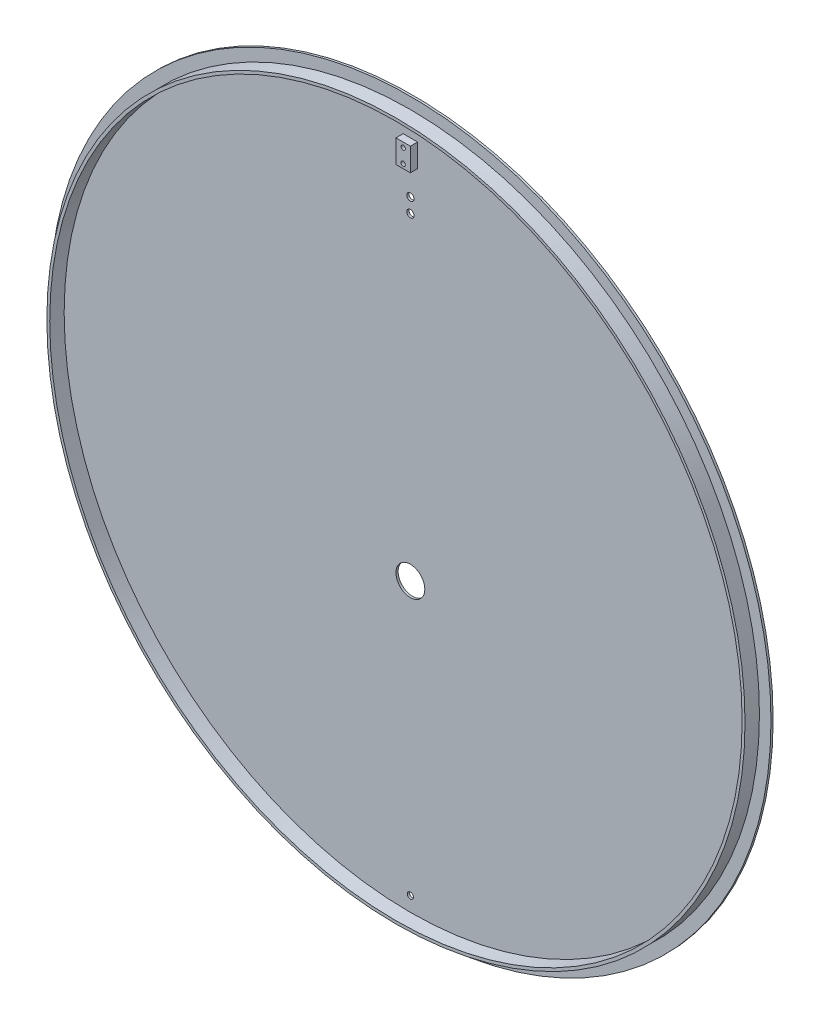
from build123d import *

# Parameters (mm, degrees)
ESQUISSE2_R             = 500
EXTRUSION2_DEPTH        = 3
ESQUISSE3_R             = 484
ESQUISSE3_R_2           = 476
EXTRUSION3_DEPTH        = 20
ESQUISSE4_R             = 480
ENL_V_MAT_EXTRU_1_DEPTH = 20
ESQUISSE5_R             = 20
ENL_V_MAT_EXTRU_2_DEPTH = 708.389567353
TROU_TARAUD_M101_D      = 8.5
TROU_TARAUD_M101_DEPTH  = 24.5
TROU_TARAUD_M101_TIP    = 2.553657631
ESQUISSE8_R             = 5
ENL_V_MAT_EXTRU_3_DEPTH = 708.389567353
ESQUISSE9_W             = 20
ESQUISSE9_H             = 32
ESQUISSE9_R             = 3
EXTRUSION4_DEPTH        = 10


with BuildPart() as part:
    # Esquisse2 → Extrusion2 (new body)
    with BuildSketch(Plane.XY):
        Circle(ESQUISSE2_R)
    extrude(amount=EXTRUSION2_DEPTH)

    # Esquisse3 → Extrusion3 (add)
    with BuildSketch(Plane.XY.offset(3)):
        Circle(ESQUISSE3_R)
        Circle(ESQUISSE3_R_2, mode=Mode.SUBTRACT)
    extrude(amount=EXTRUSION3_DEPTH)

    # Esquisse4 → Enl_v. mat.-Extru.1 (cut)
    with BuildSketch(Plane.XY.offset(23)):
        Circle(ESQUISSE4_R)
    extrude(amount=-ENL_V_MAT_EXTRU_1_DEPTH, mode=Mode.SUBTRACT)

    # Esquisse5 → Enl_v. mat.-Extru.2 (cut, through all)
    with BuildSketch(Plane.XY.offset(3)):
        with Locations((0, -82)):
            Circle(ESQUISSE5_R)
    extrude(amount=-ENL_V_MAT_EXTRU_2_DEPTH, mode=Mode.SUBTRACT)

    # Trou taraud_ M101
    with Locations(Plane(origin=(0, -459.81, 3), x_dir=(1, 0, 0), z_dir=(0, 0, 1))):
        with Locations((0, 0)):
            Hole(TROU_TARAUD_M101_D / 2, depth=TROU_TARAUD_M101_DEPTH)
            with Locations((0, 0, -(TROU_TARAUD_M101_DEPTH + TROU_TARAUD_M101_TIP / 2))):  # 118° drill point
                Cone(0, TROU_TARAUD_M101_D / 2, TROU_TARAUD_M101_TIP, mode=Mode.SUBTRACT)

    # Esquisse8 → Enl_v. mat.-Extru.3 (cut, through all)
    with BuildSketch(Plane.XY.offset(3)):
        with Locations((0, 359)):
            Circle(ESQUISSE8_R)
        with Locations((0, 379)):
            Circle(ESQUISSE8_R)
    extrude(amount=-ENL_V_MAT_EXTRU_3_DEPTH, mode=Mode.SUBTRACT)

    # Esquisse9 → Extrusion4 (add)
    with BuildSketch(Plane.XY.offset(3)):
        with Locations((0, 434)):
            Rectangle(ESQUISSE9_W, ESQUISSE9_H)
        with Locations((0, 424)):
            Circle(ESQUISSE9_R, mode=Mode.SUBTRACT)
        with Locations((0, 443.27)):
            Circle(ESQUISSE9_R, mode=Mode.SUBTRACT)
    extrude(amount=EXTRUSION4_DEPTH)


solid = part.part
